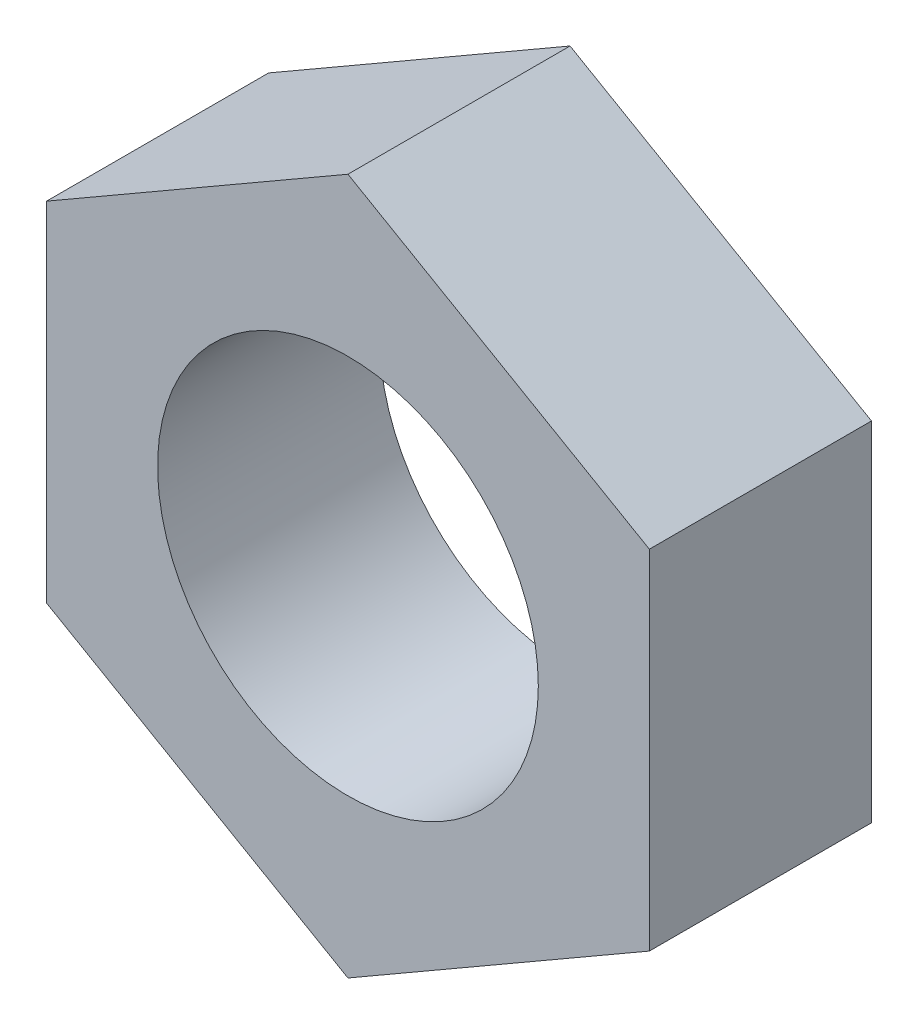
ISO-10303-21;
HEADER;
FILE_DESCRIPTION(('STEP AP214'),'2;1');
FILE_NAME('part.step','',(''),(''),'','','');
FILE_SCHEMA(('AUTOMOTIVE_DESIGN { 1 0 10303 214 1 1 1 1 }'));
ENDSEC;
DATA;
#1=APPLICATION_CONTEXT('core data for automotive mechanical design processes');
#2=APPLICATION_PROTOCOL_DEFINITION('international standard','automotive_design',2000,#1);
#3=PRODUCT_CONTEXT('',#1,'mechanical');
#4=PRODUCT('Part','Part','',(#3));
#5=PRODUCT_RELATED_PRODUCT_CATEGORY('part','',(#4));
#6=PRODUCT_DEFINITION_FORMATION('','',#4);
#7=PRODUCT_DEFINITION_CONTEXT('part definition',#1,'design');
#8=PRODUCT_DEFINITION('design','',#6,#7);
#9=PRODUCT_DEFINITION_SHAPE('','',#8);
#10=(LENGTH_UNIT() NAMED_UNIT(*) SI_UNIT(.MILLI.,.METRE.));
#11=(NAMED_UNIT(*) PLANE_ANGLE_UNIT() SI_UNIT($,.RADIAN.));
#12=(NAMED_UNIT(*) SI_UNIT($,.STERADIAN.) SOLID_ANGLE_UNIT());
#13=UNCERTAINTY_MEASURE_WITH_UNIT(LENGTH_MEASURE(1.E-05),#10,'distance_accuracy_value','');
#14=(GEOMETRIC_REPRESENTATION_CONTEXT(3) GLOBAL_UNCERTAINTY_ASSIGNED_CONTEXT((#13)) GLOBAL_UNIT_ASSIGNED_CONTEXT((#10,
#11,#12)) REPRESENTATION_CONTEXT('',''));
#15=CARTESIAN_POINT('',(0.,0.,0.));
#16=DIRECTION('',(0.,0.,1.));
#17=DIRECTION('',(1.,0.,0.));
#18=AXIS2_PLACEMENT_3D('',#15,#16,#17);
#19=CARTESIAN_POINT('',(9.5,5.48482755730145,0.));
#20=DIRECTION('',(0.5,0.866025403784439,0.));
#21=DIRECTION('',(-0.866025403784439,0.5,0.));
#22=AXIS2_PLACEMENT_3D('',#19,#20,#21);
#23=PLANE('',#22);
#24=DIRECTION('',(-0.866025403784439,0.5,0.));
#25=VECTOR('',#24,1.);
#26=CARTESIAN_POINT('',(9.5,5.48482755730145,7.));
#27=LINE('',#26,#25);
#28=CARTESIAN_POINT('',(9.5,5.48482755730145,7.));
#29=VERTEX_POINT('',#28);
#30=CARTESIAN_POINT('',(0.,10.9696551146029,7.));
#31=VERTEX_POINT('',#30);
#32=EDGE_CURVE('E66',#29,#31,#27,.T.);
#33=ORIENTED_EDGE('',*,*,#32,.F.);
#34=DIRECTION('',(0.,0.,1.));
#35=VECTOR('',#34,1.);
#36=CARTESIAN_POINT('',(9.5,5.48482755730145,0.));
#37=LINE('',#36,#35);
#38=CARTESIAN_POINT('',(9.5,5.48482755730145,0.));
#39=VERTEX_POINT('',#38);
#40=EDGE_CURVE('E9',#39,#29,#37,.T.);
#41=ORIENTED_EDGE('',*,*,#40,.F.);
#42=DIRECTION('',(-0.866025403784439,0.5,0.));
#43=VECTOR('',#42,1.);
#44=CARTESIAN_POINT('',(9.5,5.48482755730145,0.));
#45=LINE('',#44,#43);
#46=CARTESIAN_POINT('',(0.,10.9696551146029,0.));
#47=VERTEX_POINT('',#46);
#48=EDGE_CURVE('E68',#39,#47,#45,.T.);
#49=ORIENTED_EDGE('',*,*,#48,.T.);
#50=DIRECTION('',(0.,0.,1.));
#51=VECTOR('',#50,1.);
#52=CARTESIAN_POINT('',(0.,10.9696551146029,0.));
#53=LINE('',#52,#51);
#54=EDGE_CURVE('E17',#47,#31,#53,.T.);
#55=ORIENTED_EDGE('',*,*,#54,.T.);
#56=EDGE_LOOP('',(#33,#41,#49,#55));
#57=FACE_BOUND('',#56,.T.);
#58=ADVANCED_FACE('F14',(#57),#23,.T.);
#59=CARTESIAN_POINT('',(9.5,-5.48482755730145,0.));
#60=DIRECTION('',(1.,0.,0.));
#61=DIRECTION('',(0.,1.,0.));
#62=AXIS2_PLACEMENT_3D('',#59,#60,#61);
#63=PLANE('',#62);
#64=DIRECTION('',(0.,1.,0.));
#65=VECTOR('',#64,1.);
#66=CARTESIAN_POINT('',(9.5,-5.48482755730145,7.));
#67=LINE('',#66,#65);
#68=CARTESIAN_POINT('',(9.5,-5.48482755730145,7.));
#69=VERTEX_POINT('',#68);
#70=EDGE_CURVE('E84',#69,#29,#67,.T.);
#71=ORIENTED_EDGE('',*,*,#70,.F.);
#72=DIRECTION('',(0.,0.,1.));
#73=VECTOR('',#72,1.);
#74=CARTESIAN_POINT('',(9.5,-5.48482755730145,0.));
#75=LINE('',#74,#73);
#76=CARTESIAN_POINT('',(9.5,-5.48482755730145,0.));
#77=VERTEX_POINT('',#76);
#78=EDGE_CURVE('E22',#77,#69,#75,.T.);
#79=ORIENTED_EDGE('',*,*,#78,.F.);
#80=DIRECTION('',(0.,1.,0.));
#81=VECTOR('',#80,1.);
#82=CARTESIAN_POINT('',(9.5,-5.48482755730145,0.));
#83=LINE('',#82,#81);
#84=EDGE_CURVE('E73',#77,#39,#83,.T.);
#85=ORIENTED_EDGE('',*,*,#84,.T.);
#86=ORIENTED_EDGE('',*,*,#40,.T.);
#87=EDGE_LOOP('',(#71,#79,#85,#86));
#88=FACE_BOUND('',#87,.T.);
#89=ADVANCED_FACE('F124',(#88),#63,.T.);
#90=CARTESIAN_POINT('',(0.,-10.9696551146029,0.));
#91=DIRECTION('',(0.5,-0.866025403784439,0.));
#92=DIRECTION('',(0.866025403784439,0.5,0.));
#93=AXIS2_PLACEMENT_3D('',#90,#91,#92);
#94=PLANE('',#93);
#95=DIRECTION('',(0.866025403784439,0.5,0.));
#96=VECTOR('',#95,1.);
#97=CARTESIAN_POINT('',(0.,-10.9696551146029,7.));
#98=LINE('',#97,#96);
#99=CARTESIAN_POINT('',(0.,-10.9696551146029,7.));
#100=VERTEX_POINT('',#99);
#101=EDGE_CURVE('E96',#100,#69,#98,.T.);
#102=ORIENTED_EDGE('',*,*,#101,.F.);
#103=DIRECTION('',(0.,0.,1.));
#104=VECTOR('',#103,1.);
#105=CARTESIAN_POINT('',(0.,-10.9696551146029,0.));
#106=LINE('',#105,#104);
#107=CARTESIAN_POINT('',(0.,-10.9696551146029,0.));
#108=VERTEX_POINT('',#107);
#109=EDGE_CURVE('E112',#108,#100,#106,.T.);
#110=ORIENTED_EDGE('',*,*,#109,.F.);
#111=DIRECTION('',(0.866025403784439,0.5,0.));
#112=VECTOR('',#111,1.);
#113=CARTESIAN_POINT('',(0.,-10.9696551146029,0.));
#114=LINE('',#113,#112);
#115=EDGE_CURVE('E108',#108,#77,#114,.T.);
#116=ORIENTED_EDGE('',*,*,#115,.T.);
#117=ORIENTED_EDGE('',*,*,#78,.T.);
#118=EDGE_LOOP('',(#102,#110,#116,#117));
#119=FACE_BOUND('',#118,.T.);
#120=ADVANCED_FACE('F129',(#119),#94,.T.);
#121=CARTESIAN_POINT('',(-9.5,-5.48482755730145,0.));
#122=DIRECTION('',(-0.5,-0.866025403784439,0.));
#123=DIRECTION('',(0.866025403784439,-0.5,0.));
#124=AXIS2_PLACEMENT_3D('',#121,#122,#123);
#125=PLANE('',#124);
#126=DIRECTION('',(0.866025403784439,-0.5,0.));
#127=VECTOR('',#126,1.);
#128=CARTESIAN_POINT('',(-9.5,-5.48482755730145,7.));
#129=LINE('',#128,#127);
#130=CARTESIAN_POINT('',(-9.5,-5.48482755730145,7.));
#131=VERTEX_POINT('',#130);
#132=EDGE_CURVE('E93',#131,#100,#129,.T.);
#133=ORIENTED_EDGE('',*,*,#132,.F.);
#134=DIRECTION('',(0.,0.,1.));
#135=VECTOR('',#134,1.);
#136=CARTESIAN_POINT('',(-9.5,-5.48482755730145,0.));
#137=LINE('',#136,#135);
#138=CARTESIAN_POINT('',(-9.5,-5.48482755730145,0.));
#139=VERTEX_POINT('',#138);
#140=EDGE_CURVE('E114',#139,#131,#137,.T.);
#141=ORIENTED_EDGE('',*,*,#140,.F.);
#142=DIRECTION('',(0.866025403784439,-0.5,0.));
#143=VECTOR('',#142,1.);
#144=CARTESIAN_POINT('',(-9.5,-5.48482755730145,0.));
#145=LINE('',#144,#143);
#146=EDGE_CURVE('E105',#139,#108,#145,.T.);
#147=ORIENTED_EDGE('',*,*,#146,.T.);
#148=ORIENTED_EDGE('',*,*,#109,.T.);
#149=EDGE_LOOP('',(#133,#141,#147,#148));
#150=FACE_BOUND('',#149,.T.);
#151=ADVANCED_FACE('F121',(#150),#125,.T.);
#152=CARTESIAN_POINT('',(-9.5,5.48482755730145,0.));
#153=DIRECTION('',(-1.,0.,0.));
#154=DIRECTION('',(0.,0.,1.));
#155=AXIS2_PLACEMENT_3D('',#152,#153,#154);
#156=PLANE('',#155);
#157=DIRECTION('',(0.,-1.,0.));
#158=VECTOR('',#157,1.);
#159=CARTESIAN_POINT('',(-9.5,5.48482755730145,7.));
#160=LINE('',#159,#158);
#161=CARTESIAN_POINT('',(-9.5,5.48482755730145,7.));
#162=VERTEX_POINT('',#161);
#163=EDGE_CURVE('E80',#162,#131,#160,.T.);
#164=ORIENTED_EDGE('',*,*,#163,.F.);
#165=DIRECTION('',(0.,0.,1.));
#166=VECTOR('',#165,1.);
#167=CARTESIAN_POINT('',(-9.5,5.48482755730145,0.));
#168=LINE('',#167,#166);
#169=CARTESIAN_POINT('',(-9.5,5.48482755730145,0.));
#170=VERTEX_POINT('',#169);
#171=EDGE_CURVE('E72',#170,#162,#168,.T.);
#172=ORIENTED_EDGE('',*,*,#171,.F.);
#173=DIRECTION('',(0.,-1.,0.));
#174=VECTOR('',#173,1.);
#175=CARTESIAN_POINT('',(-9.5,5.48482755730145,0.));
#176=LINE('',#175,#174);
#177=EDGE_CURVE('E102',#170,#139,#176,.T.);
#178=ORIENTED_EDGE('',*,*,#177,.T.);
#179=ORIENTED_EDGE('',*,*,#140,.T.);
#180=EDGE_LOOP('',(#164,#172,#178,#179));
#181=FACE_BOUND('',#180,.T.);
#182=ADVANCED_FACE('F117',(#181),#156,.T.);
#183=CARTESIAN_POINT('',(0.,10.9696551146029,0.));
#184=DIRECTION('',(-0.5,0.866025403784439,0.));
#185=DIRECTION('',(-0.866025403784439,-0.5,0.));
#186=AXIS2_PLACEMENT_3D('',#183,#184,#185);
#187=PLANE('',#186);
#188=DIRECTION('',(-0.866025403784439,-0.5,0.));
#189=VECTOR('',#188,1.);
#190=CARTESIAN_POINT('',(0.,10.9696551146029,7.));
#191=LINE('',#190,#189);
#192=EDGE_CURVE('E75',#31,#162,#191,.T.);
#193=ORIENTED_EDGE('',*,*,#192,.F.);
#194=ORIENTED_EDGE('',*,*,#54,.F.);
#195=DIRECTION('',(-0.866025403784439,-0.5,0.));
#196=VECTOR('',#195,1.);
#197=CARTESIAN_POINT('',(0.,10.9696551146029,0.));
#198=LINE('',#197,#196);
#199=EDGE_CURVE('E100',#47,#170,#198,.T.);
#200=ORIENTED_EDGE('',*,*,#199,.T.);
#201=ORIENTED_EDGE('',*,*,#171,.T.);
#202=EDGE_LOOP('',(#193,#194,#200,#201));
#203=FACE_BOUND('',#202,.T.);
#204=ADVANCED_FACE('F76',(#203),#187,.T.);
#205=CARTESIAN_POINT('',(0.,10.9696551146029,0.));
#206=DIRECTION('',(0.,0.,1.));
#207=DIRECTION('',(1.,0.,0.));
#208=AXIS2_PLACEMENT_3D('',#205,#206,#207);
#209=PLANE('',#208);
#210=CARTESIAN_POINT('',(0.,0.,0.));
#211=DIRECTION('',(0.,0.,1.));
#212=DIRECTION('',(1.,0.,0.));
#213=AXIS2_PLACEMENT_3D('',#210,#211,#212);
#214=CIRCLE('',#213,6.);
#215=CARTESIAN_POINT('',(6.,0.,0.));
#216=VERTEX_POINT('',#215);
#217=EDGE_CURVE('E85',#216,#216,#214,.T.);
#218=ORIENTED_EDGE('',*,*,#217,.T.);
#219=EDGE_LOOP('',(#218));
#220=FACE_BOUND('',#219,.T.);
#221=ORIENTED_EDGE('',*,*,#48,.F.);
#222=ORIENTED_EDGE('',*,*,#84,.F.);
#223=ORIENTED_EDGE('',*,*,#115,.F.);
#224=ORIENTED_EDGE('',*,*,#146,.F.);
#225=ORIENTED_EDGE('',*,*,#177,.F.);
#226=ORIENTED_EDGE('',*,*,#199,.F.);
#227=EDGE_LOOP('',(#221,#222,#223,#224,#225,#226));
#228=FACE_BOUND('',#227,.T.);
#229=ADVANCED_FACE('F128',(#220,#228),#209,.F.);
#230=CARTESIAN_POINT('',(0.,10.9696551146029,7.));
#231=DIRECTION('',(0.,0.,1.));
#232=DIRECTION('',(1.,0.,0.));
#233=AXIS2_PLACEMENT_3D('',#230,#231,#232);
#234=PLANE('',#233);
#235=CARTESIAN_POINT('',(0.,0.,7.));
#236=DIRECTION('',(0.,0.,1.));
#237=DIRECTION('',(1.,0.,0.));
#238=AXIS2_PLACEMENT_3D('',#235,#236,#237);
#239=CIRCLE('',#238,6.);
#240=CARTESIAN_POINT('',(6.,0.,7.));
#241=VERTEX_POINT('',#240);
#242=EDGE_CURVE('E88',#241,#241,#239,.T.);
#243=ORIENTED_EDGE('',*,*,#242,.F.);
#244=EDGE_LOOP('',(#243));
#245=FACE_BOUND('',#244,.T.);
#246=ORIENTED_EDGE('',*,*,#32,.T.);
#247=ORIENTED_EDGE('',*,*,#192,.T.);
#248=ORIENTED_EDGE('',*,*,#163,.T.);
#249=ORIENTED_EDGE('',*,*,#132,.T.);
#250=ORIENTED_EDGE('',*,*,#101,.T.);
#251=ORIENTED_EDGE('',*,*,#70,.T.);
#252=EDGE_LOOP('',(#246,#247,#248,#249,#250,#251));
#253=FACE_BOUND('',#252,.T.);
#254=ADVANCED_FACE('F82',(#245,#253),#234,.T.);
#255=CARTESIAN_POINT('',(0.,0.,7.));
#256=DIRECTION('',(0.,0.,1.));
#257=DIRECTION('',(1.,0.,0.));
#258=AXIS2_PLACEMENT_3D('',#255,#256,#257);
#259=CYLINDRICAL_SURFACE('',#258,6.);
#260=ORIENTED_EDGE('',*,*,#217,.F.);
#261=EDGE_LOOP('',(#260));
#262=FACE_BOUND('',#261,.T.);
#263=ORIENTED_EDGE('',*,*,#242,.T.);
#264=EDGE_LOOP('',(#263));
#265=FACE_BOUND('',#264,.T.);
#266=ADVANCED_FACE('F194',(#262,#265),#259,.F.);
#267=CLOSED_SHELL('',(#58,#89,#120,#151,#182,#204,#229,#254,#266));
#268=MANIFOLD_SOLID_BREP('B1',#267);
#269=ADVANCED_BREP_SHAPE_REPRESENTATION('',(#18,#268),#14);
#270=SHAPE_DEFINITION_REPRESENTATION(#9,#269);
ENDSEC;
END-ISO-10303-21;
